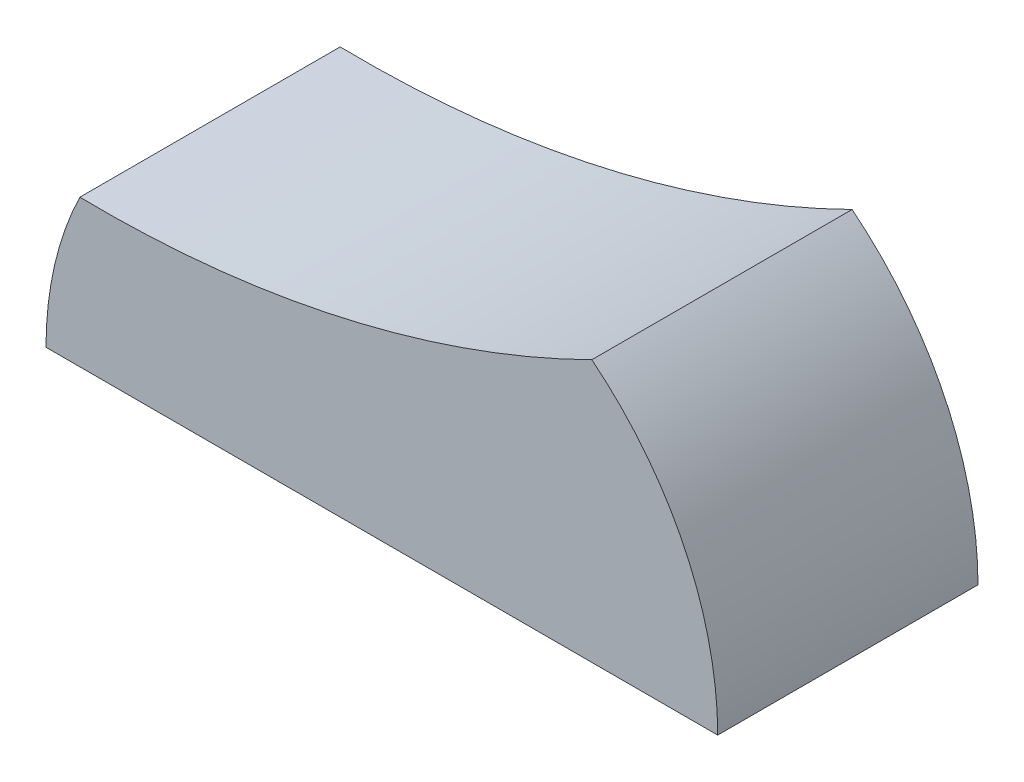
ISO-10303-21;
HEADER;
FILE_DESCRIPTION(('STEP AP214'),'2;1');
FILE_NAME('part.step','',(''),(''),'','','');
FILE_SCHEMA(('AUTOMOTIVE_DESIGN { 1 0 10303 214 1 1 1 1 }'));
ENDSEC;
DATA;
#1=APPLICATION_CONTEXT('core data for automotive mechanical design processes');
#2=APPLICATION_PROTOCOL_DEFINITION('international standard','automotive_design',2000,#1);
#3=PRODUCT_CONTEXT('',#1,'mechanical');
#4=PRODUCT('Part','Part','',(#3));
#5=PRODUCT_RELATED_PRODUCT_CATEGORY('part','',(#4));
#6=PRODUCT_DEFINITION_FORMATION('','',#4);
#7=PRODUCT_DEFINITION_CONTEXT('part definition',#1,'design');
#8=PRODUCT_DEFINITION('design','',#6,#7);
#9=PRODUCT_DEFINITION_SHAPE('','',#8);
#10=(LENGTH_UNIT() NAMED_UNIT(*) SI_UNIT(.MILLI.,.METRE.));
#11=(NAMED_UNIT(*) PLANE_ANGLE_UNIT() SI_UNIT($,.RADIAN.));
#12=(NAMED_UNIT(*) SI_UNIT($,.STERADIAN.) SOLID_ANGLE_UNIT());
#13=UNCERTAINTY_MEASURE_WITH_UNIT(LENGTH_MEASURE(1.E-05),#10,'distance_accuracy_value','');
#14=(GEOMETRIC_REPRESENTATION_CONTEXT(3) GLOBAL_UNCERTAINTY_ASSIGNED_CONTEXT((#13)) GLOBAL_UNIT_ASSIGNED_CONTEXT((#10,
#11,#12)) REPRESENTATION_CONTEXT('',''));
#15=CARTESIAN_POINT('',(0.,0.,0.));
#16=DIRECTION('',(0.,0.,1.));
#17=DIRECTION('',(1.,0.,0.));
#18=AXIS2_PLACEMENT_3D('',#15,#16,#17);
#19=CARTESIAN_POINT('',(0.,0.,40.550326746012));
#20=DIRECTION('',(0.,0.,-1.));
#21=DIRECTION('',(-1.,0.,0.));
#22=AXIS2_PLACEMENT_3D('',#19,#20,#21);
#23=CYLINDRICAL_SURFACE('',#22,16.);
#24=CARTESIAN_POINT('',(0.,0.,6.19999999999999));
#25=DIRECTION('',(0.,0.,1.));
#26=DIRECTION('',(1.,0.,0.));
#27=AXIS2_PLACEMENT_3D('',#24,#25,#26);
#28=CIRCLE('',#27,16.);
#29=CARTESIAN_POINT('',(16.,0.,6.19999999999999));
#30=VERTEX_POINT('',#29);
#31=CARTESIAN_POINT('',(10.0027522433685,12.4877919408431,6.19999999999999));
#32=VERTEX_POINT('',#31);
#33=EDGE_CURVE('E68',#30,#32,#28,.T.);
#34=ORIENTED_EDGE('',*,*,#33,.F.);
#35=DIRECTION('',(0.,0.,-1.));
#36=VECTOR('',#35,1.);
#37=CARTESIAN_POINT('',(16.,0.,40.550326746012));
#38=LINE('',#37,#36);
#39=CARTESIAN_POINT('',(16.,0.,-6.2));
#40=VERTEX_POINT('',#39);
#41=EDGE_CURVE('E19',#30,#40,#38,.T.);
#42=ORIENTED_EDGE('',*,*,#41,.T.);
#43=CARTESIAN_POINT('',(0.,0.,-6.2));
#44=DIRECTION('',(0.,0.,-1.));
#45=DIRECTION('',(-1.,0.,0.));
#46=AXIS2_PLACEMENT_3D('',#43,#44,#45);
#47=CIRCLE('',#46,16.);
#48=CARTESIAN_POINT('',(10.0027522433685,12.4877919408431,-6.2));
#49=VERTEX_POINT('',#48);
#50=EDGE_CURVE('E66',#40,#49,#47,.F.);
#51=ORIENTED_EDGE('',*,*,#50,.T.);
#52=DIRECTION('',(0.,0.,-1.));
#53=VECTOR('',#52,1.);
#54=CARTESIAN_POINT('',(10.0027522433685,12.4877919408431,40.550326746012));
#55=LINE('',#54,#53);
#56=EDGE_CURVE('E54',#32,#49,#55,.T.);
#57=ORIENTED_EDGE('',*,*,#56,.F.);
#58=EDGE_LOOP('',(#34,#42,#51,#57));
#59=FACE_BOUND('',#58,.T.);
#60=ADVANCED_FACE('F15',(#59),#23,.T.);
#61=CARTESIAN_POINT('',(-13.460637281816,59.8252027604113,40.550326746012));
#62=DIRECTION('',(0.,0.,-1.));
#63=DIRECTION('',(-1.,0.,0.));
#64=AXIS2_PLACEMENT_3D('',#61,#62,#63);
#65=CYLINDRICAL_SURFACE('',#64,52.8333333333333);
#66=CARTESIAN_POINT('',(-13.460637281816,59.8252027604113,6.19999999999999));
#67=DIRECTION('',(0.,0.,1.));
#68=DIRECTION('',(1.,0.,0.));
#69=AXIS2_PLACEMENT_3D('',#66,#67,#68);
#70=CIRCLE('',#69,52.8333333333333);
#71=CARTESIAN_POINT('',(-14.3874945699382,7.,6.19999999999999));
#72=VERTEX_POINT('',#71);
#73=EDGE_CURVE('E24',#32,#72,#70,.F.);
#74=ORIENTED_EDGE('',*,*,#73,.F.);
#75=ORIENTED_EDGE('',*,*,#56,.T.);
#76=CARTESIAN_POINT('',(-13.460637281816,59.8252027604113,-6.2));
#77=DIRECTION('',(0.,0.,-1.));
#78=DIRECTION('',(-1.,0.,0.));
#79=AXIS2_PLACEMENT_3D('',#76,#77,#78);
#80=CIRCLE('',#79,52.8333333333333);
#81=CARTESIAN_POINT('',(-14.3874945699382,7.,-6.2));
#82=VERTEX_POINT('',#81);
#83=EDGE_CURVE('E74',#49,#82,#80,.T.);
#84=ORIENTED_EDGE('',*,*,#83,.T.);
#85=DIRECTION('',(0.,0.,-1.));
#86=VECTOR('',#85,1.);
#87=CARTESIAN_POINT('',(-14.3874945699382,7.,40.550326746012));
#88=LINE('',#87,#86);
#89=EDGE_CURVE('E59',#72,#82,#88,.T.);
#90=ORIENTED_EDGE('',*,*,#89,.F.);
#91=EDGE_LOOP('',(#74,#75,#84,#90));
#92=FACE_BOUND('',#91,.T.);
#93=ADVANCED_FACE('F89',(#92),#65,.F.);
#94=CARTESIAN_POINT('',(0.,0.,40.550326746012));
#95=DIRECTION('',(0.,0.,-1.));
#96=DIRECTION('',(-1.,0.,0.));
#97=AXIS2_PLACEMENT_3D('',#94,#95,#96);
#98=CYLINDRICAL_SURFACE('',#97,16.);
#99=CARTESIAN_POINT('',(0.,0.,6.19999999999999));
#100=DIRECTION('',(0.,0.,1.));
#101=DIRECTION('',(1.,0.,0.));
#102=AXIS2_PLACEMENT_3D('',#99,#100,#101);
#103=CIRCLE('',#102,16.);
#104=CARTESIAN_POINT('',(-16.,0.,6.19999999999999));
#105=VERTEX_POINT('',#104);
#106=EDGE_CURVE('E10',#72,#105,#103,.T.);
#107=ORIENTED_EDGE('',*,*,#106,.F.);
#108=ORIENTED_EDGE('',*,*,#89,.T.);
#109=CARTESIAN_POINT('',(0.,0.,-6.2));
#110=DIRECTION('',(0.,0.,-1.));
#111=DIRECTION('',(-1.,0.,0.));
#112=AXIS2_PLACEMENT_3D('',#109,#110,#111);
#113=CIRCLE('',#112,16.);
#114=CARTESIAN_POINT('',(-16.,0.,-6.2));
#115=VERTEX_POINT('',#114);
#116=EDGE_CURVE('E77',#82,#115,#113,.F.);
#117=ORIENTED_EDGE('',*,*,#116,.T.);
#118=DIRECTION('',(0.,0.,-1.));
#119=VECTOR('',#118,1.);
#120=CARTESIAN_POINT('',(-16.,0.,40.550326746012));
#121=LINE('',#120,#119);
#122=EDGE_CURVE('E40',#105,#115,#121,.T.);
#123=ORIENTED_EDGE('',*,*,#122,.F.);
#124=EDGE_LOOP('',(#107,#108,#117,#123));
#125=FACE_BOUND('',#124,.T.);
#126=ADVANCED_FACE('F88',(#125),#98,.T.);
#127=CARTESIAN_POINT('',(-16.,0.,40.550326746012));
#128=DIRECTION('',(0.,1.,0.));
#129=DIRECTION('',(0.,0.,1.));
#130=AXIS2_PLACEMENT_3D('',#127,#128,#129);
#131=PLANE('',#130);
#132=DIRECTION('',(1.,0.,0.));
#133=VECTOR('',#132,1.);
#134=CARTESIAN_POINT('',(-16.,0.,6.19999999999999));
#135=LINE('',#134,#133);
#136=EDGE_CURVE('E84',#105,#30,#135,.T.);
#137=ORIENTED_EDGE('',*,*,#136,.F.);
#138=ORIENTED_EDGE('',*,*,#122,.T.);
#139=DIRECTION('',(1.,0.,0.));
#140=VECTOR('',#139,1.);
#141=CARTESIAN_POINT('',(-16.,0.,-6.2));
#142=LINE('',#141,#140);
#143=EDGE_CURVE('E73',#115,#40,#142,.T.);
#144=ORIENTED_EDGE('',*,*,#143,.T.);
#145=ORIENTED_EDGE('',*,*,#41,.F.);
#146=EDGE_LOOP('',(#137,#138,#144,#145));
#147=FACE_BOUND('',#146,.T.);
#148=ADVANCED_FACE('F76',(#147),#131,.F.);
#149=CARTESIAN_POINT('',(-16.,-39.5595753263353,6.19999999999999));
#150=DIRECTION('',(0.,0.,1.));
#151=DIRECTION('',(1.,0.,0.));
#152=AXIS2_PLACEMENT_3D('',#149,#150,#151);
#153=PLANE('',#152);
#154=ORIENTED_EDGE('',*,*,#136,.T.);
#155=ORIENTED_EDGE('',*,*,#33,.T.);
#156=ORIENTED_EDGE('',*,*,#73,.T.);
#157=ORIENTED_EDGE('',*,*,#106,.T.);
#158=EDGE_LOOP('',(#154,#155,#156,#157));
#159=FACE_BOUND('',#158,.T.);
#160=ADVANCED_FACE('F17',(#159),#153,.T.);
#161=CARTESIAN_POINT('',(16.,-39.5595753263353,-6.2));
#162=DIRECTION('',(0.,0.,-1.));
#163=DIRECTION('',(-1.,0.,0.));
#164=AXIS2_PLACEMENT_3D('',#161,#162,#163);
#165=PLANE('',#164);
#166=ORIENTED_EDGE('',*,*,#50,.F.);
#167=ORIENTED_EDGE('',*,*,#143,.F.);
#168=ORIENTED_EDGE('',*,*,#116,.F.);
#169=ORIENTED_EDGE('',*,*,#83,.F.);
#170=EDGE_LOOP('',(#166,#167,#168,#169));
#171=FACE_BOUND('',#170,.T.);
#172=ADVANCED_FACE('F72',(#171),#165,.T.);
#173=CLOSED_SHELL('',(#60,#93,#126,#148,#160,#172));
#174=MANIFOLD_SOLID_BREP('B1',#173);
#175=ADVANCED_BREP_SHAPE_REPRESENTATION('',(#18,#174),#14);
#176=SHAPE_DEFINITION_REPRESENTATION(#9,#175);
ENDSEC;
END-ISO-10303-21;
